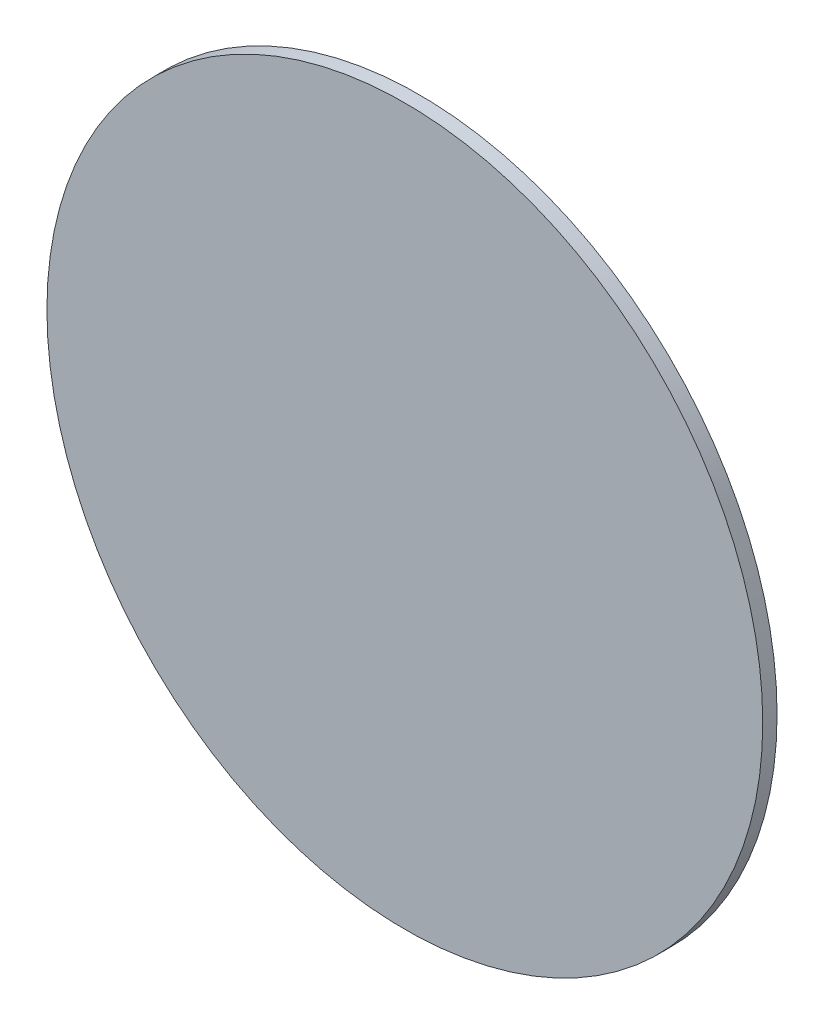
ISO-10303-21;
HEADER;
FILE_DESCRIPTION(('STEP AP214'),'2;1');
FILE_NAME('part.step','',(''),(''),'','','');
FILE_SCHEMA(('AUTOMOTIVE_DESIGN { 1 0 10303 214 1 1 1 1 }'));
ENDSEC;
DATA;
#1=APPLICATION_CONTEXT('core data for automotive mechanical design processes');
#2=APPLICATION_PROTOCOL_DEFINITION('international standard','automotive_design',2000,#1);
#3=PRODUCT_CONTEXT('',#1,'mechanical');
#4=PRODUCT('Part','Part','',(#3));
#5=PRODUCT_RELATED_PRODUCT_CATEGORY('part','',(#4));
#6=PRODUCT_DEFINITION_FORMATION('','',#4);
#7=PRODUCT_DEFINITION_CONTEXT('part definition',#1,'design');
#8=PRODUCT_DEFINITION('design','',#6,#7);
#9=PRODUCT_DEFINITION_SHAPE('','',#8);
#10=(LENGTH_UNIT() NAMED_UNIT(*) SI_UNIT(.MILLI.,.METRE.));
#11=(NAMED_UNIT(*) PLANE_ANGLE_UNIT() SI_UNIT($,.RADIAN.));
#12=(NAMED_UNIT(*) SI_UNIT($,.STERADIAN.) SOLID_ANGLE_UNIT());
#13=UNCERTAINTY_MEASURE_WITH_UNIT(LENGTH_MEASURE(1.E-05),#10,'distance_accuracy_value','');
#14=(GEOMETRIC_REPRESENTATION_CONTEXT(3) GLOBAL_UNCERTAINTY_ASSIGNED_CONTEXT((#13)) GLOBAL_UNIT_ASSIGNED_CONTEXT((#10,
#11,#12)) REPRESENTATION_CONTEXT('',''));
#15=CARTESIAN_POINT('',(0.,0.,0.));
#16=DIRECTION('',(0.,0.,1.));
#17=DIRECTION('',(1.,0.,0.));
#18=AXIS2_PLACEMENT_3D('',#15,#16,#17);
#19=CARTESIAN_POINT('',(0.,0.,0.5));
#20=DIRECTION('',(0.,0.,-1.));
#21=DIRECTION('',(-1.,0.,0.));
#22=AXIS2_PLACEMENT_3D('',#19,#20,#21);
#23=CYLINDRICAL_SURFACE('',#22,12.5);
#24=CARTESIAN_POINT('',(0.,0.,0.5));
#25=DIRECTION('',(0.,0.,1.));
#26=DIRECTION('',(1.,0.,0.));
#27=AXIS2_PLACEMENT_3D('',#24,#25,#26);
#28=CIRCLE('',#27,12.5);
#29=CARTESIAN_POINT('',(12.5,0.,0.5));
#30=VERTEX_POINT('',#29);
#31=EDGE_CURVE('E10',#30,#30,#28,.T.);
#32=ORIENTED_EDGE('',*,*,#31,.F.);
#33=EDGE_LOOP('',(#32));
#34=FACE_BOUND('',#33,.T.);
#35=CARTESIAN_POINT('',(0.,0.,0.));
#36=DIRECTION('',(0.,0.,1.));
#37=DIRECTION('',(1.,0.,0.));
#38=AXIS2_PLACEMENT_3D('',#35,#36,#37);
#39=CIRCLE('',#38,12.5);
#40=CARTESIAN_POINT('',(12.5,0.,0.));
#41=VERTEX_POINT('',#40);
#42=EDGE_CURVE('E33',#41,#41,#39,.T.);
#43=ORIENTED_EDGE('',*,*,#42,.T.);
#44=EDGE_LOOP('',(#43));
#45=FACE_BOUND('',#44,.T.);
#46=ADVANCED_FACE('F30',(#34,#45),#23,.T.);
#47=CARTESIAN_POINT('',(0.,0.,0.5));
#48=DIRECTION('',(0.,0.,1.));
#49=DIRECTION('',(1.,0.,0.));
#50=AXIS2_PLACEMENT_3D('',#47,#48,#49);
#51=PLANE('',#50);
#52=ORIENTED_EDGE('',*,*,#31,.T.);
#53=EDGE_LOOP('',(#52));
#54=FACE_BOUND('',#53,.T.);
#55=ADVANCED_FACE('F45',(#54),#51,.T.);
#56=CARTESIAN_POINT('',(0.,0.,0.));
#57=DIRECTION('',(0.,0.,1.));
#58=DIRECTION('',(1.,0.,0.));
#59=AXIS2_PLACEMENT_3D('',#56,#57,#58);
#60=PLANE('',#59);
#61=ORIENTED_EDGE('',*,*,#42,.F.);
#62=EDGE_LOOP('',(#61));
#63=FACE_BOUND('',#62,.T.);
#64=ADVANCED_FACE('F43',(#63),#60,.F.);
#65=CLOSED_SHELL('',(#46,#55,#64));
#66=MANIFOLD_SOLID_BREP('B2',#65);
#67=ADVANCED_BREP_SHAPE_REPRESENTATION('',(#18,#66),#14);
#68=SHAPE_DEFINITION_REPRESENTATION(#9,#67);
ENDSEC;
END-ISO-10303-21;
